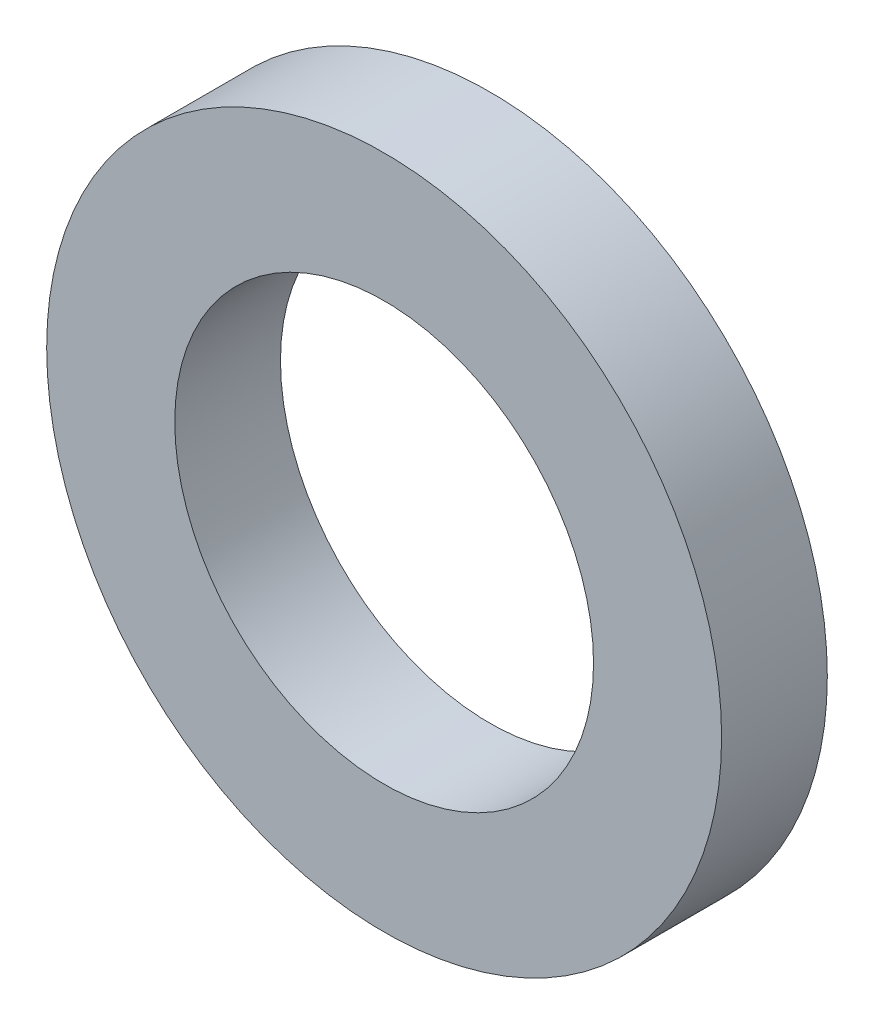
from build123d import *

# Parameters (mm, degrees)
ESQUISSE1_R      = 8.3
ESQUISSE1_R_2    = 5.15
EXTRUSION1_DEPTH = 2.6


with BuildPart() as part:
    # Esquisse1 → Extrusion1 (new body)
    with BuildSketch(Plane.XY):
        Circle(ESQUISSE1_R)
        Circle(ESQUISSE1_R_2, mode=Mode.SUBTRACT)
    extrude(amount=EXTRUSION1_DEPTH)


solid = part.part
